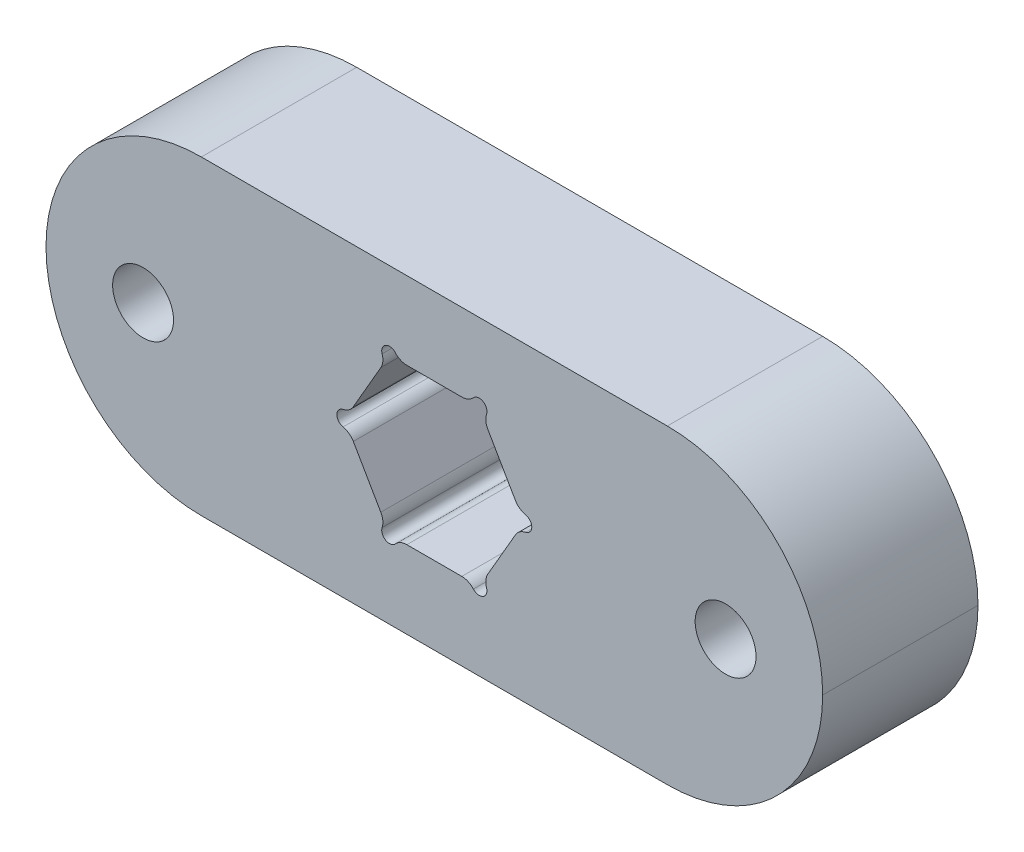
ISO-10303-21;
HEADER;
FILE_DESCRIPTION(('STEP AP214'),'2;1');
FILE_NAME('part.step','',(''),(''),'','','');
FILE_SCHEMA(('AUTOMOTIVE_DESIGN { 1 0 10303 214 1 1 1 1 }'));
ENDSEC;
DATA;
#1=APPLICATION_CONTEXT('core data for automotive mechanical design processes');
#2=APPLICATION_PROTOCOL_DEFINITION('international standard','automotive_design',2000,#1);
#3=PRODUCT_CONTEXT('',#1,'mechanical');
#4=PRODUCT('Part','Part','',(#3));
#5=PRODUCT_RELATED_PRODUCT_CATEGORY('part','',(#4));
#6=PRODUCT_DEFINITION_FORMATION('','',#4);
#7=PRODUCT_DEFINITION_CONTEXT('part definition',#1,'design');
#8=PRODUCT_DEFINITION('design','',#6,#7);
#9=PRODUCT_DEFINITION_SHAPE('','',#8);
#10=(LENGTH_UNIT() NAMED_UNIT(*) SI_UNIT(.MILLI.,.METRE.));
#11=(NAMED_UNIT(*) PLANE_ANGLE_UNIT() SI_UNIT($,.RADIAN.));
#12=(NAMED_UNIT(*) SI_UNIT($,.STERADIAN.) SOLID_ANGLE_UNIT());
#13=UNCERTAINTY_MEASURE_WITH_UNIT(LENGTH_MEASURE(1.E-05),#10,'distance_accuracy_value','');
#14=(GEOMETRIC_REPRESENTATION_CONTEXT(3) GLOBAL_UNCERTAINTY_ASSIGNED_CONTEXT((#13)) GLOBAL_UNIT_ASSIGNED_CONTEXT((#10,
#11,#12)) REPRESENTATION_CONTEXT('',''));
#15=CARTESIAN_POINT('',(0.,0.,0.));
#16=DIRECTION('',(0.,0.,1.));
#17=DIRECTION('',(1.,0.,0.));
#18=AXIS2_PLACEMENT_3D('',#15,#16,#17);
#19=CARTESIAN_POINT('',(0.,0.,12.7));
#20=DIRECTION('',(0.,0.,1.));
#21=DIRECTION('',(1.,0.,0.));
#22=AXIS2_PLACEMENT_3D('',#19,#20,#21);
#23=PLANE('',#22);
#24=DIRECTION('',(0.500000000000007,-0.866025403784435,0.));
#25=VECTOR('',#24,1.);
#26=CARTESIAN_POINT('',(-7.33234841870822,0.,12.7));
#27=LINE('',#26,#25);
#28=CARTESIAN_POINT('',(-6.62239683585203,-1.2296722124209,12.7));
#29=VERTEX_POINT('',#28);
#30=CARTESIAN_POINT('',(-4.37612579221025,-5.12032778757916,12.7));
#31=VERTEX_POINT('',#30);
#32=EDGE_CURVE('E318',#29,#31,#27,.T.);
#33=ORIENTED_EDGE('',*,*,#32,.F.);
#34=CARTESIAN_POINT('',(-7.72224909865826,-1.86467221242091,12.7));
#35=DIRECTION('',(0.,0.,1.));
#36=DIRECTION('',(1.,0.,0.));
#37=AXIS2_PLACEMENT_3D('',#34,#35,#36);
#38=CIRCLE('',#37,1.27);
#39=CARTESIAN_POINT('',(-7.4623153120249,-0.621557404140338,12.7));
#40=VERTEX_POINT('',#39);
#41=EDGE_CURVE('E263',#29,#40,#38,.T.);
#42=ORIENTED_EDGE('',*,*,#41,.T.);
#43=CARTESIAN_POINT('',(-7.33234841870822,0.,12.7));
#44=DIRECTION('',(0.,0.,1.));
#45=DIRECTION('',(1.,0.,0.));
#46=AXIS2_PLACEMENT_3D('',#43,#44,#45);
#47=CIRCLE('',#46,0.635000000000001);
#48=CARTESIAN_POINT('',(-7.46231531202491,0.621557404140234,12.7));
#49=VERTEX_POINT('',#48);
#50=EDGE_CURVE('E253',#49,#40,#47,.T.);
#51=ORIENTED_EDGE('',*,*,#50,.F.);
#52=CARTESIAN_POINT('',(-7.72224909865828,1.8646722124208,12.7));
#53=DIRECTION('',(0.,0.,1.));
#54=DIRECTION('',(1.,0.,0.));
#55=AXIS2_PLACEMENT_3D('',#52,#53,#54);
#56=CIRCLE('',#55,1.27);
#57=CARTESIAN_POINT('',(-6.62239683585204,1.22967221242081,12.7));
#58=VERTEX_POINT('',#57);
#59=EDGE_CURVE('E235',#49,#58,#56,.T.);
#60=ORIENTED_EDGE('',*,*,#59,.T.);
#61=DIRECTION('',(-0.499999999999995,-0.866025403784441,0.));
#62=VECTOR('',#61,1.);
#63=CARTESIAN_POINT('',(-3.66617420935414,6.34999999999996,12.7));
#64=LINE('',#63,#62);
#65=CARTESIAN_POINT('',(-4.37612579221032,5.1203277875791,12.7));
#66=VERTEX_POINT('',#65);
#67=EDGE_CURVE('E316',#66,#58,#64,.T.);
#68=ORIENTED_EDGE('',*,*,#67,.F.);
#69=CARTESIAN_POINT('',(-5.47597805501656,5.75532778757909,12.7));
#70=DIRECTION('',(0.,0.,1.));
#71=DIRECTION('',(1.,0.,0.));
#72=AXIS2_PLACEMENT_3D('',#69,#70,#71);
#73=CIRCLE('',#72,1.27);
#74=CARTESIAN_POINT('',(-4.26944215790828,6.15177592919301,12.7));
#75=VERTEX_POINT('',#74);
#76=EDGE_CURVE('E246',#66,#75,#73,.T.);
#77=ORIENTED_EDGE('',*,*,#76,.T.);
#78=CARTESIAN_POINT('',(-3.66617420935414,6.34999999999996,12.7));
#79=DIRECTION('',(0.,0.,1.));
#80=DIRECTION('',(1.,0.,0.));
#81=AXIS2_PLACEMENT_3D('',#78,#79,#80);
#82=CIRCLE('',#81,0.635);
#83=CARTESIAN_POINT('',(-3.19287315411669,6.7733333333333,12.7));
#84=VERTEX_POINT('',#83);
#85=EDGE_CURVE('E291',#84,#75,#82,.T.);
#86=ORIENTED_EDGE('',*,*,#85,.F.);
#87=CARTESIAN_POINT('',(-2.24627104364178,7.61999999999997,12.7));
#88=DIRECTION('',(0.,0.,1.));
#89=DIRECTION('',(1.,0.,0.));
#90=AXIS2_PLACEMENT_3D('',#87,#88,#89);
#91=CIRCLE('',#90,1.27);
#92=CARTESIAN_POINT('',(-2.24627104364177,6.34999999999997,12.7));
#93=VERTEX_POINT('',#92);
#94=EDGE_CURVE('E385',#84,#93,#91,.T.);
#95=ORIENTED_EDGE('',*,*,#94,.T.);
#96=DIRECTION('',(-1.,0.,0.));
#97=VECTOR('',#96,1.);
#98=CARTESIAN_POINT('',(3.6661742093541,6.34999999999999,12.7));
#99=LINE('',#98,#97);
#100=CARTESIAN_POINT('',(2.24627104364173,6.34999999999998,12.7));
#101=VERTEX_POINT('',#100);
#102=EDGE_CURVE('E313',#101,#93,#99,.T.);
#103=ORIENTED_EDGE('',*,*,#102,.F.);
#104=CARTESIAN_POINT('',(2.24627104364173,7.61999999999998,12.7));
#105=DIRECTION('',(0.,0.,1.));
#106=DIRECTION('',(1.,0.,0.));
#107=AXIS2_PLACEMENT_3D('',#104,#105,#106);
#108=CIRCLE('',#107,1.27);
#109=CARTESIAN_POINT('',(3.19287315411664,6.77333333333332,12.7));
#110=VERTEX_POINT('',#109);
#111=EDGE_CURVE('E245',#101,#110,#108,.T.);
#112=ORIENTED_EDGE('',*,*,#111,.T.);
#113=CARTESIAN_POINT('',(3.6661742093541,6.34999999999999,12.7));
#114=DIRECTION('',(0.,0.,1.));
#115=DIRECTION('',(1.,0.,0.));
#116=AXIS2_PLACEMENT_3D('',#113,#114,#115);
#117=CIRCLE('',#116,0.635);
#118=CARTESIAN_POINT('',(4.26944215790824,6.15177592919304,12.7));
#119=VERTEX_POINT('',#118);
#120=EDGE_CURVE('E285',#119,#110,#117,.T.);
#121=ORIENTED_EDGE('',*,*,#120,.F.);
#122=CARTESIAN_POINT('',(5.47597805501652,5.75532778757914,12.7));
#123=DIRECTION('',(0.,0.,1.));
#124=DIRECTION('',(1.,0.,0.));
#125=AXIS2_PLACEMENT_3D('',#122,#123,#124);
#126=CIRCLE('',#125,1.27);
#127=CARTESIAN_POINT('',(4.37612579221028,5.12032778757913,12.7));
#128=VERTEX_POINT('',#127);
#129=EDGE_CURVE('E389',#119,#128,#126,.T.);
#130=ORIENTED_EDGE('',*,*,#129,.T.);
#131=DIRECTION('',(-0.500000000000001,0.866025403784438,0.));
#132=VECTOR('',#131,1.);
#133=CARTESIAN_POINT('',(7.33234841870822,0.,12.7));
#134=LINE('',#133,#132);
#135=CARTESIAN_POINT('',(6.62239683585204,1.22967221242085,12.7));
#136=VERTEX_POINT('',#135);
#137=EDGE_CURVE('E309',#136,#128,#134,.T.);
#138=ORIENTED_EDGE('',*,*,#137,.F.);
#139=CARTESIAN_POINT('',(7.72224909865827,1.86467221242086,12.7));
#140=DIRECTION('',(0.,0.,1.));
#141=DIRECTION('',(1.,0.,0.));
#142=AXIS2_PLACEMENT_3D('',#139,#140,#141);
#143=CIRCLE('',#142,1.27);
#144=CARTESIAN_POINT('',(7.46231531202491,0.621557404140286,12.7));
#145=VERTEX_POINT('',#144);
#146=EDGE_CURVE('E391',#136,#145,#143,.T.);
#147=ORIENTED_EDGE('',*,*,#146,.T.);
#148=CARTESIAN_POINT('',(7.33234841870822,0.,12.7));
#149=DIRECTION('',(0.,0.,1.));
#150=DIRECTION('',(1.,0.,0.));
#151=AXIS2_PLACEMENT_3D('',#148,#149,#150);
#152=CIRCLE('',#151,0.635000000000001);
#153=CARTESIAN_POINT('',(7.46231531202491,-0.621557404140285,12.7));
#154=VERTEX_POINT('',#153);
#155=EDGE_CURVE('E279',#154,#145,#152,.T.);
#156=ORIENTED_EDGE('',*,*,#155,.F.);
#157=CARTESIAN_POINT('',(7.72224909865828,-1.86467221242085,12.7));
#158=DIRECTION('',(0.,0.,1.));
#159=DIRECTION('',(1.,0.,0.));
#160=AXIS2_PLACEMENT_3D('',#157,#158,#159);
#161=CIRCLE('',#160,1.27);
#162=CARTESIAN_POINT('',(6.62239683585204,-1.22967221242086,12.7));
#163=VERTEX_POINT('',#162);
#164=EDGE_CURVE('E393',#154,#163,#161,.T.);
#165=ORIENTED_EDGE('',*,*,#164,.T.);
#166=DIRECTION('',(0.499999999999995,0.866025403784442,0.));
#167=VECTOR('',#166,1.);
#168=CARTESIAN_POINT('',(3.66617420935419,-6.34999999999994,12.7));
#169=LINE('',#168,#167);
#170=CARTESIAN_POINT('',(4.37612579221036,-5.12032778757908,12.7));
#171=VERTEX_POINT('',#170);
#172=EDGE_CURVE('E306',#171,#163,#169,.T.);
#173=ORIENTED_EDGE('',*,*,#172,.F.);
#174=CARTESIAN_POINT('',(5.4759780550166,-5.75532778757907,12.7));
#175=DIRECTION('',(0.,0.,1.));
#176=DIRECTION('',(1.,0.,0.));
#177=AXIS2_PLACEMENT_3D('',#174,#175,#176);
#178=CIRCLE('',#177,1.27);
#179=CARTESIAN_POINT('',(4.26944215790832,-6.15177592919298,12.7));
#180=VERTEX_POINT('',#179);
#181=EDGE_CURVE('E395',#171,#180,#178,.T.);
#182=ORIENTED_EDGE('',*,*,#181,.T.);
#183=CARTESIAN_POINT('',(3.66617420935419,-6.34999999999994,12.7));
#184=DIRECTION('',(0.,0.,1.));
#185=DIRECTION('',(1.,0.,0.));
#186=AXIS2_PLACEMENT_3D('',#183,#184,#185);
#187=CIRCLE('',#186,0.635);
#188=CARTESIAN_POINT('',(3.19287315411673,-6.77333333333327,12.7));
#189=VERTEX_POINT('',#188);
#190=EDGE_CURVE('E273',#189,#180,#187,.T.);
#191=ORIENTED_EDGE('',*,*,#190,.F.);
#192=CARTESIAN_POINT('',(2.24627104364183,-7.61999999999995,12.7));
#193=DIRECTION('',(0.,0.,1.));
#194=DIRECTION('',(1.,0.,0.));
#195=AXIS2_PLACEMENT_3D('',#192,#193,#194);
#196=CIRCLE('',#195,1.27);
#197=CARTESIAN_POINT('',(2.24627104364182,-6.34999999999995,12.7));
#198=VERTEX_POINT('',#197);
#199=EDGE_CURVE('E397',#189,#198,#196,.T.);
#200=ORIENTED_EDGE('',*,*,#199,.T.);
#201=DIRECTION('',(1.,0.,0.));
#202=VECTOR('',#201,1.);
#203=CARTESIAN_POINT('',(-3.66617420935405,-6.35000000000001,12.7));
#204=LINE('',#203,#202);
#205=CARTESIAN_POINT('',(-2.24627104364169,-6.35,12.7));
#206=VERTEX_POINT('',#205);
#207=EDGE_CURVE('E321',#206,#198,#204,.T.);
#208=ORIENTED_EDGE('',*,*,#207,.F.);
#209=CARTESIAN_POINT('',(-2.24627104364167,-7.62,12.7));
#210=DIRECTION('',(0.,0.,1.));
#211=DIRECTION('',(1.,0.,0.));
#212=AXIS2_PLACEMENT_3D('',#209,#210,#211);
#213=CIRCLE('',#212,1.27);
#214=CARTESIAN_POINT('',(-3.19287315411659,-6.77333333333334,12.7));
#215=VERTEX_POINT('',#214);
#216=EDGE_CURVE('E399',#206,#215,#213,.T.);
#217=ORIENTED_EDGE('',*,*,#216,.T.);
#218=CARTESIAN_POINT('',(-3.66617420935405,-6.35000000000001,12.7));
#219=DIRECTION('',(0.,0.,1.));
#220=DIRECTION('',(1.,0.,0.));
#221=AXIS2_PLACEMENT_3D('',#218,#219,#220);
#222=CIRCLE('',#221,0.635);
#223=CARTESIAN_POINT('',(-4.26944215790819,-6.15177592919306,12.7));
#224=VERTEX_POINT('',#223);
#225=EDGE_CURVE('E266',#224,#215,#222,.T.);
#226=ORIENTED_EDGE('',*,*,#225,.F.);
#227=CARTESIAN_POINT('',(-5.47597805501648,-5.75532778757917,12.7));
#228=DIRECTION('',(0.,0.,1.));
#229=DIRECTION('',(1.,0.,0.));
#230=AXIS2_PLACEMENT_3D('',#227,#228,#229);
#231=CIRCLE('',#230,1.27);
#232=EDGE_CURVE('E401',#224,#31,#231,.T.);
#233=ORIENTED_EDGE('',*,*,#232,.T.);
#234=EDGE_LOOP('',(#33,#42,#51,#60,#68,#77,#86,#95,#103,#112,#121,#130,#138,#147,#156,#165,#173,
#182,#191,#200,#208,#217,#226,#233));
#235=FACE_BOUND('',#234,.T.);
#236=CARTESIAN_POINT('',(-23.8125,0.,12.7));
#237=DIRECTION('',(0.,0.,1.));
#238=DIRECTION('',(1.,0.,0.));
#239=AXIS2_PLACEMENT_3D('',#236,#237,#238);
#240=CIRCLE('',#239,2.4892);
#241=CARTESIAN_POINT('',(-21.3233,0.,12.7));
#242=VERTEX_POINT('',#241);
#243=EDGE_CURVE('E341',#242,#242,#240,.T.);
#244=ORIENTED_EDGE('',*,*,#243,.F.);
#245=EDGE_LOOP('',(#244));
#246=FACE_BOUND('',#245,.T.);
#247=DIRECTION('',(-1.,0.,0.));
#248=VECTOR('',#247,1.);
#249=CARTESIAN_POINT('',(31.75,12.7,12.7));
#250=LINE('',#249,#248);
#251=CARTESIAN_POINT('',(19.05,12.7,12.7));
#252=VERTEX_POINT('',#251);
#253=CARTESIAN_POINT('',(-19.05,12.7,12.7));
#254=VERTEX_POINT('',#253);
#255=EDGE_CURVE('E258',#252,#254,#250,.T.);
#256=ORIENTED_EDGE('',*,*,#255,.T.);
#257=CARTESIAN_POINT('',(-19.05,0.,12.7));
#258=DIRECTION('',(0.,0.,1.));
#259=DIRECTION('',(1.,0.,0.));
#260=AXIS2_PLACEMENT_3D('',#257,#258,#259);
#261=CIRCLE('',#260,12.7);
#262=CARTESIAN_POINT('',(-31.75,0.,12.7));
#263=VERTEX_POINT('',#262);
#264=EDGE_CURVE('E471',#254,#263,#261,.T.);
#265=ORIENTED_EDGE('',*,*,#264,.T.);
#266=CARTESIAN_POINT('',(-19.05,0.,12.7));
#267=DIRECTION('',(0.,0.,1.));
#268=DIRECTION('',(1.,0.,0.));
#269=AXIS2_PLACEMENT_3D('',#266,#267,#268);
#270=CIRCLE('',#269,12.7);
#271=CARTESIAN_POINT('',(-19.05,-12.7,12.7));
#272=VERTEX_POINT('',#271);
#273=EDGE_CURVE('E469',#263,#272,#270,.T.);
#274=ORIENTED_EDGE('',*,*,#273,.T.);
#275=DIRECTION('',(1.,0.,0.));
#276=VECTOR('',#275,1.);
#277=CARTESIAN_POINT('',(31.75,-12.7,12.7));
#278=LINE('',#277,#276);
#279=CARTESIAN_POINT('',(19.05,-12.7,12.7));
#280=VERTEX_POINT('',#279);
#281=EDGE_CURVE('E347',#272,#280,#278,.T.);
#282=ORIENTED_EDGE('',*,*,#281,.T.);
#283=CARTESIAN_POINT('',(19.05,0.,12.7));
#284=DIRECTION('',(0.,0.,1.));
#285=DIRECTION('',(1.,0.,0.));
#286=AXIS2_PLACEMENT_3D('',#283,#284,#285);
#287=CIRCLE('',#286,12.7);
#288=CARTESIAN_POINT('',(31.75,0.,12.7));
#289=VERTEX_POINT('',#288);
#290=EDGE_CURVE('E54',#280,#289,#287,.T.);
#291=ORIENTED_EDGE('',*,*,#290,.T.);
#292=CARTESIAN_POINT('',(19.05,0.,12.7));
#293=DIRECTION('',(0.,0.,1.));
#294=DIRECTION('',(1.,0.,0.));
#295=AXIS2_PLACEMENT_3D('',#292,#293,#294);
#296=CIRCLE('',#295,12.7);
#297=EDGE_CURVE('E466',#289,#252,#296,.T.);
#298=ORIENTED_EDGE('',*,*,#297,.T.);
#299=EDGE_LOOP('',(#256,#265,#274,#282,#291,#298));
#300=FACE_BOUND('',#299,.T.);
#301=CARTESIAN_POINT('',(23.8125,0.,12.7));
#302=DIRECTION('',(0.,0.,1.));
#303=DIRECTION('',(1.,0.,0.));
#304=AXIS2_PLACEMENT_3D('',#301,#302,#303);
#305=CIRCLE('',#304,2.4892);
#306=CARTESIAN_POINT('',(26.3017,0.,12.7));
#307=VERTEX_POINT('',#306);
#308=EDGE_CURVE('E300',#307,#307,#305,.T.);
#309=ORIENTED_EDGE('',*,*,#308,.F.);
#310=EDGE_LOOP('',(#309));
#311=FACE_BOUND('',#310,.T.);
#312=ADVANCED_FACE('F37',(#235,#246,#300,#311),#23,.T.);
#313=CARTESIAN_POINT('',(0.,0.,0.));
#314=DIRECTION('',(0.,0.,1.));
#315=DIRECTION('',(1.,0.,0.));
#316=AXIS2_PLACEMENT_3D('',#313,#314,#315);
#317=PLANE('',#316);
#318=CARTESIAN_POINT('',(-23.8125,0.,0.));
#319=DIRECTION('',(0.,0.,1.));
#320=DIRECTION('',(1.,0.,0.));
#321=AXIS2_PLACEMENT_3D('',#318,#319,#320);
#322=CIRCLE('',#321,2.4892);
#323=CARTESIAN_POINT('',(-21.3233,0.,0.));
#324=VERTEX_POINT('',#323);
#325=EDGE_CURVE('E324',#324,#324,#322,.T.);
#326=ORIENTED_EDGE('',*,*,#325,.T.);
#327=EDGE_LOOP('',(#326));
#328=FACE_BOUND('',#327,.T.);
#329=CARTESIAN_POINT('',(-19.05,0.,0.));
#330=DIRECTION('',(0.,0.,1.));
#331=DIRECTION('',(1.,0.,0.));
#332=AXIS2_PLACEMENT_3D('',#329,#330,#331);
#333=CIRCLE('',#332,12.7);
#334=CARTESIAN_POINT('',(-19.05,-12.7,0.));
#335=VERTEX_POINT('',#334);
#336=CARTESIAN_POINT('',(-31.75,0.,0.));
#337=VERTEX_POINT('',#336);
#338=EDGE_CURVE('E457',#335,#337,#333,.F.);
#339=ORIENTED_EDGE('',*,*,#338,.T.);
#340=CARTESIAN_POINT('',(-19.05,0.,0.));
#341=DIRECTION('',(0.,0.,1.));
#342=DIRECTION('',(1.,0.,0.));
#343=AXIS2_PLACEMENT_3D('',#340,#341,#342);
#344=CIRCLE('',#343,12.7);
#345=CARTESIAN_POINT('',(-19.05,12.7,0.));
#346=VERTEX_POINT('',#345);
#347=EDGE_CURVE('E459',#337,#346,#344,.F.);
#348=ORIENTED_EDGE('',*,*,#347,.T.);
#349=DIRECTION('',(-1.,0.,0.));
#350=VECTOR('',#349,1.);
#351=CARTESIAN_POINT('',(31.75,12.7,0.));
#352=LINE('',#351,#350);
#353=CARTESIAN_POINT('',(19.05,12.7,0.));
#354=VERTEX_POINT('',#353);
#355=EDGE_CURVE('E349',#354,#346,#352,.T.);
#356=ORIENTED_EDGE('',*,*,#355,.F.);
#357=CARTESIAN_POINT('',(19.05,0.,0.));
#358=DIRECTION('',(0.,0.,1.));
#359=DIRECTION('',(1.,0.,0.));
#360=AXIS2_PLACEMENT_3D('',#357,#358,#359);
#361=CIRCLE('',#360,12.7);
#362=CARTESIAN_POINT('',(31.75,0.,0.));
#363=VERTEX_POINT('',#362);
#364=EDGE_CURVE('E453',#354,#363,#361,.F.);
#365=ORIENTED_EDGE('',*,*,#364,.T.);
#366=CARTESIAN_POINT('',(19.05,0.,0.));
#367=DIRECTION('',(0.,0.,1.));
#368=DIRECTION('',(1.,0.,0.));
#369=AXIS2_PLACEMENT_3D('',#366,#367,#368);
#370=CIRCLE('',#369,12.7);
#371=CARTESIAN_POINT('',(19.05,-12.7,0.));
#372=VERTEX_POINT('',#371);
#373=EDGE_CURVE('E455',#363,#372,#370,.F.);
#374=ORIENTED_EDGE('',*,*,#373,.T.);
#375=DIRECTION('',(1.,0.,0.));
#376=VECTOR('',#375,1.);
#377=CARTESIAN_POINT('',(31.75,-12.7,0.));
#378=LINE('',#377,#376);
#379=EDGE_CURVE('E344',#335,#372,#378,.T.);
#380=ORIENTED_EDGE('',*,*,#379,.F.);
#381=EDGE_LOOP('',(#339,#348,#356,#365,#374,#380));
#382=FACE_BOUND('',#381,.T.);
#383=CARTESIAN_POINT('',(-7.33234841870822,0.,0.));
#384=DIRECTION('',(0.,0.,1.));
#385=DIRECTION('',(1.,0.,0.));
#386=AXIS2_PLACEMENT_3D('',#383,#384,#385);
#387=CIRCLE('',#386,0.635000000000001);
#388=CARTESIAN_POINT('',(-7.46231531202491,0.621557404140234,0.));
#389=VERTEX_POINT('',#388);
#390=CARTESIAN_POINT('',(-7.4623153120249,-0.621557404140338,0.));
#391=VERTEX_POINT('',#390);
#392=EDGE_CURVE('E256',#389,#391,#387,.T.);
#393=ORIENTED_EDGE('',*,*,#392,.T.);
#394=CARTESIAN_POINT('',(-7.72224909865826,-1.86467221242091,0.));
#395=DIRECTION('',(0.,0.,1.));
#396=DIRECTION('',(1.,0.,0.));
#397=AXIS2_PLACEMENT_3D('',#394,#395,#396);
#398=CIRCLE('',#397,1.27);
#399=CARTESIAN_POINT('',(-6.62239683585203,-1.2296722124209,0.));
#400=VERTEX_POINT('',#399);
#401=EDGE_CURVE('E379',#391,#400,#398,.F.);
#402=ORIENTED_EDGE('',*,*,#401,.T.);
#403=DIRECTION('',(0.500000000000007,-0.866025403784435,0.));
#404=VECTOR('',#403,1.);
#405=CARTESIAN_POINT('',(-7.33234841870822,0.,0.));
#406=LINE('',#405,#404);
#407=CARTESIAN_POINT('',(-4.37612579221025,-5.12032778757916,0.));
#408=VERTEX_POINT('',#407);
#409=EDGE_CURVE('E336',#400,#408,#406,.T.);
#410=ORIENTED_EDGE('',*,*,#409,.T.);
#411=CARTESIAN_POINT('',(-5.47597805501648,-5.75532778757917,0.));
#412=DIRECTION('',(0.,0.,1.));
#413=DIRECTION('',(1.,0.,0.));
#414=AXIS2_PLACEMENT_3D('',#411,#412,#413);
#415=CIRCLE('',#414,1.27);
#416=CARTESIAN_POINT('',(-4.26944215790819,-6.15177592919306,0.));
#417=VERTEX_POINT('',#416);
#418=EDGE_CURVE('E377',#408,#417,#415,.F.);
#419=ORIENTED_EDGE('',*,*,#418,.T.);
#420=CARTESIAN_POINT('',(-3.66617420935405,-6.35000000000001,0.));
#421=DIRECTION('',(0.,0.,1.));
#422=DIRECTION('',(1.,0.,0.));
#423=AXIS2_PLACEMENT_3D('',#420,#421,#422);
#424=CIRCLE('',#423,0.635);
#425=CARTESIAN_POINT('',(-3.19287315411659,-6.77333333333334,0.));
#426=VERTEX_POINT('',#425);
#427=EDGE_CURVE('E270',#417,#426,#424,.T.);
#428=ORIENTED_EDGE('',*,*,#427,.T.);
#429=CARTESIAN_POINT('',(-2.24627104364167,-7.62,0.));
#430=DIRECTION('',(0.,0.,1.));
#431=DIRECTION('',(1.,0.,0.));
#432=AXIS2_PLACEMENT_3D('',#429,#430,#431);
#433=CIRCLE('',#432,1.27);
#434=CARTESIAN_POINT('',(-2.24627104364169,-6.35,0.));
#435=VERTEX_POINT('',#434);
#436=EDGE_CURVE('E375',#426,#435,#433,.F.);
#437=ORIENTED_EDGE('',*,*,#436,.T.);
#438=DIRECTION('',(1.,0.,0.));
#439=VECTOR('',#438,1.);
#440=CARTESIAN_POINT('',(-3.66617420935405,-6.35000000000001,0.));
#441=LINE('',#440,#439);
#442=CARTESIAN_POINT('',(2.24627104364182,-6.34999999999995,0.));
#443=VERTEX_POINT('',#442);
#444=EDGE_CURVE('E310',#435,#443,#441,.T.);
#445=ORIENTED_EDGE('',*,*,#444,.T.);
#446=CARTESIAN_POINT('',(2.24627104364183,-7.61999999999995,0.));
#447=DIRECTION('',(0.,0.,1.));
#448=DIRECTION('',(1.,0.,0.));
#449=AXIS2_PLACEMENT_3D('',#446,#447,#448);
#450=CIRCLE('',#449,1.27);
#451=CARTESIAN_POINT('',(3.19287315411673,-6.77333333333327,0.));
#452=VERTEX_POINT('',#451);
#453=EDGE_CURVE('E373',#443,#452,#450,.F.);
#454=ORIENTED_EDGE('',*,*,#453,.T.);
#455=CARTESIAN_POINT('',(3.66617420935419,-6.34999999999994,0.));
#456=DIRECTION('',(0.,0.,1.));
#457=DIRECTION('',(1.,0.,0.));
#458=AXIS2_PLACEMENT_3D('',#455,#456,#457);
#459=CIRCLE('',#458,0.635);
#460=CARTESIAN_POINT('',(4.26944215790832,-6.15177592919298,0.));
#461=VERTEX_POINT('',#460);
#462=EDGE_CURVE('E276',#452,#461,#459,.T.);
#463=ORIENTED_EDGE('',*,*,#462,.T.);
#464=CARTESIAN_POINT('',(5.4759780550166,-5.75532778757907,0.));
#465=DIRECTION('',(0.,0.,1.));
#466=DIRECTION('',(1.,0.,0.));
#467=AXIS2_PLACEMENT_3D('',#464,#465,#466);
#468=CIRCLE('',#467,1.27);
#469=CARTESIAN_POINT('',(4.37612579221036,-5.12032778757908,0.));
#470=VERTEX_POINT('',#469);
#471=EDGE_CURVE('E371',#461,#470,#468,.F.);
#472=ORIENTED_EDGE('',*,*,#471,.T.);
#473=DIRECTION('',(0.499999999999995,0.866025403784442,0.));
#474=VECTOR('',#473,1.);
#475=CARTESIAN_POINT('',(3.66617420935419,-6.34999999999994,0.));
#476=LINE('',#475,#474);
#477=CARTESIAN_POINT('',(6.62239683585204,-1.22967221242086,0.));
#478=VERTEX_POINT('',#477);
#479=EDGE_CURVE('E303',#470,#478,#476,.T.);
#480=ORIENTED_EDGE('',*,*,#479,.T.);
#481=CARTESIAN_POINT('',(7.72224909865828,-1.86467221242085,0.));
#482=DIRECTION('',(0.,0.,1.));
#483=DIRECTION('',(1.,0.,0.));
#484=AXIS2_PLACEMENT_3D('',#481,#482,#483);
#485=CIRCLE('',#484,1.27);
#486=CARTESIAN_POINT('',(7.46231531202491,-0.621557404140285,0.));
#487=VERTEX_POINT('',#486);
#488=EDGE_CURVE('E369',#478,#487,#485,.F.);
#489=ORIENTED_EDGE('',*,*,#488,.T.);
#490=CARTESIAN_POINT('',(7.33234841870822,0.,0.));
#491=DIRECTION('',(0.,0.,1.));
#492=DIRECTION('',(1.,0.,0.));
#493=AXIS2_PLACEMENT_3D('',#490,#491,#492);
#494=CIRCLE('',#493,0.635000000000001);
#495=CARTESIAN_POINT('',(7.46231531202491,0.621557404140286,0.));
#496=VERTEX_POINT('',#495);
#497=EDGE_CURVE('E282',#487,#496,#494,.T.);
#498=ORIENTED_EDGE('',*,*,#497,.T.);
#499=CARTESIAN_POINT('',(7.72224909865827,1.86467221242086,0.));
#500=DIRECTION('',(0.,0.,1.));
#501=DIRECTION('',(1.,0.,0.));
#502=AXIS2_PLACEMENT_3D('',#499,#500,#501);
#503=CIRCLE('',#502,1.27);
#504=CARTESIAN_POINT('',(6.62239683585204,1.22967221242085,0.));
#505=VERTEX_POINT('',#504);
#506=EDGE_CURVE('E367',#496,#505,#503,.F.);
#507=ORIENTED_EDGE('',*,*,#506,.T.);
#508=DIRECTION('',(-0.500000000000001,0.866025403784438,0.));
#509=VECTOR('',#508,1.);
#510=CARTESIAN_POINT('',(7.33234841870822,0.,0.));
#511=LINE('',#510,#509);
#512=CARTESIAN_POINT('',(4.37612579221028,5.12032778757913,0.));
#513=VERTEX_POINT('',#512);
#514=EDGE_CURVE('E327',#505,#513,#511,.T.);
#515=ORIENTED_EDGE('',*,*,#514,.T.);
#516=CARTESIAN_POINT('',(5.47597805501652,5.75532778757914,0.));
#517=DIRECTION('',(0.,0.,1.));
#518=DIRECTION('',(1.,0.,0.));
#519=AXIS2_PLACEMENT_3D('',#516,#517,#518);
#520=CIRCLE('',#519,1.27);
#521=CARTESIAN_POINT('',(4.26944215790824,6.15177592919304,0.));
#522=VERTEX_POINT('',#521);
#523=EDGE_CURVE('E365',#513,#522,#520,.F.);
#524=ORIENTED_EDGE('',*,*,#523,.T.);
#525=CARTESIAN_POINT('',(3.6661742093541,6.34999999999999,0.));
#526=DIRECTION('',(0.,0.,1.));
#527=DIRECTION('',(1.,0.,0.));
#528=AXIS2_PLACEMENT_3D('',#525,#526,#527);
#529=CIRCLE('',#528,0.635);
#530=CARTESIAN_POINT('',(3.19287315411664,6.77333333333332,0.));
#531=VERTEX_POINT('',#530);
#532=EDGE_CURVE('E288',#522,#531,#529,.T.);
#533=ORIENTED_EDGE('',*,*,#532,.T.);
#534=CARTESIAN_POINT('',(2.24627104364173,7.61999999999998,0.));
#535=DIRECTION('',(0.,0.,1.));
#536=DIRECTION('',(1.,0.,0.));
#537=AXIS2_PLACEMENT_3D('',#534,#535,#536);
#538=CIRCLE('',#537,1.27);
#539=CARTESIAN_POINT('',(2.24627104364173,6.34999999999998,0.));
#540=VERTEX_POINT('',#539);
#541=EDGE_CURVE('E363',#531,#540,#538,.F.);
#542=ORIENTED_EDGE('',*,*,#541,.T.);
#543=DIRECTION('',(-1.,0.,0.));
#544=VECTOR('',#543,1.);
#545=CARTESIAN_POINT('',(3.6661742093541,6.34999999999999,0.));
#546=LINE('',#545,#544);
#547=CARTESIAN_POINT('',(-2.24627104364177,6.34999999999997,0.));
#548=VERTEX_POINT('',#547);
#549=EDGE_CURVE('E330',#540,#548,#546,.T.);
#550=ORIENTED_EDGE('',*,*,#549,.T.);
#551=CARTESIAN_POINT('',(-2.24627104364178,7.61999999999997,0.));
#552=DIRECTION('',(0.,0.,1.));
#553=DIRECTION('',(1.,0.,0.));
#554=AXIS2_PLACEMENT_3D('',#551,#552,#553);
#555=CIRCLE('',#554,1.27);
#556=CARTESIAN_POINT('',(-3.19287315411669,6.7733333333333,0.));
#557=VERTEX_POINT('',#556);
#558=EDGE_CURVE('E357',#548,#557,#555,.F.);
#559=ORIENTED_EDGE('',*,*,#558,.T.);
#560=CARTESIAN_POINT('',(-3.66617420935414,6.34999999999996,0.));
#561=DIRECTION('',(0.,0.,1.));
#562=DIRECTION('',(1.,0.,0.));
#563=AXIS2_PLACEMENT_3D('',#560,#561,#562);
#564=CIRCLE('',#563,0.635);
#565=CARTESIAN_POINT('',(-4.26944215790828,6.15177592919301,0.));
#566=VERTEX_POINT('',#565);
#567=EDGE_CURVE('E294',#557,#566,#564,.T.);
#568=ORIENTED_EDGE('',*,*,#567,.T.);
#569=CARTESIAN_POINT('',(-5.47597805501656,5.75532778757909,0.));
#570=DIRECTION('',(0.,0.,1.));
#571=DIRECTION('',(1.,0.,0.));
#572=AXIS2_PLACEMENT_3D('',#569,#570,#571);
#573=CIRCLE('',#572,1.27);
#574=CARTESIAN_POINT('',(-4.37612579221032,5.1203277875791,0.));
#575=VERTEX_POINT('',#574);
#576=EDGE_CURVE('E359',#566,#575,#573,.F.);
#577=ORIENTED_EDGE('',*,*,#576,.T.);
#578=DIRECTION('',(-0.499999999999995,-0.866025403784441,0.));
#579=VECTOR('',#578,1.);
#580=CARTESIAN_POINT('',(-3.66617420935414,6.34999999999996,0.));
#581=LINE('',#580,#579);
#582=CARTESIAN_POINT('',(-6.62239683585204,1.22967221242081,0.));
#583=VERTEX_POINT('',#582);
#584=EDGE_CURVE('E333',#575,#583,#581,.T.);
#585=ORIENTED_EDGE('',*,*,#584,.T.);
#586=CARTESIAN_POINT('',(-7.72224909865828,1.8646722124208,0.));
#587=DIRECTION('',(0.,0.,1.));
#588=DIRECTION('',(1.,0.,0.));
#589=AXIS2_PLACEMENT_3D('',#586,#587,#588);
#590=CIRCLE('',#589,1.27);
#591=EDGE_CURVE('E361',#583,#389,#590,.F.);
#592=ORIENTED_EDGE('',*,*,#591,.T.);
#593=EDGE_LOOP('',(#393,#402,#410,#419,#428,#437,#445,#454,#463,#472,#480,#489,#498,#507,#515,
#524,#533,#542,#550,#559,#568,#577,#585,#592));
#594=FACE_BOUND('',#593,.T.);
#595=CARTESIAN_POINT('',(23.8125,0.,0.));
#596=DIRECTION('',(0.,0.,1.));
#597=DIRECTION('',(1.,0.,0.));
#598=AXIS2_PLACEMENT_3D('',#595,#596,#597);
#599=CIRCLE('',#598,2.4892);
#600=CARTESIAN_POINT('',(26.3017,0.,0.));
#601=VERTEX_POINT('',#600);
#602=EDGE_CURVE('E297',#601,#601,#599,.T.);
#603=ORIENTED_EDGE('',*,*,#602,.T.);
#604=EDGE_LOOP('',(#603));
#605=FACE_BOUND('',#604,.T.);
#606=ADVANCED_FACE('F491',(#328,#382,#594,#605),#317,.F.);
#607=CARTESIAN_POINT('',(31.75,-12.7,12.7));
#608=DIRECTION('',(0.,1.,0.));
#609=DIRECTION('',(-1.,0.,0.));
#610=AXIS2_PLACEMENT_3D('',#607,#608,#609);
#611=PLANE('',#610);
#612=ORIENTED_EDGE('',*,*,#281,.F.);
#613=DIRECTION('',(0.,0.,-1.));
#614=VECTOR('',#613,1.);
#615=CARTESIAN_POINT('',(-19.05,-12.7,12.7));
#616=LINE('',#615,#614);
#617=EDGE_CURVE('E11',#272,#335,#616,.T.);
#618=ORIENTED_EDGE('',*,*,#617,.T.);
#619=ORIENTED_EDGE('',*,*,#379,.T.);
#620=DIRECTION('',(0.,0.,-1.));
#621=VECTOR('',#620,1.);
#622=CARTESIAN_POINT('',(19.05,-12.7,12.7));
#623=LINE('',#622,#621);
#624=EDGE_CURVE('E46',#372,#280,#623,.F.);
#625=ORIENTED_EDGE('',*,*,#624,.T.);
#626=EDGE_LOOP('',(#612,#618,#619,#625));
#627=FACE_BOUND('',#626,.T.);
#628=ADVANCED_FACE('F475',(#627),#611,.F.);
#629=CARTESIAN_POINT('',(31.75,12.7,12.7));
#630=DIRECTION('',(0.,-1.,0.));
#631=DIRECTION('',(1.,0.,0.));
#632=AXIS2_PLACEMENT_3D('',#629,#630,#631);
#633=PLANE('',#632);
#634=ORIENTED_EDGE('',*,*,#355,.T.);
#635=DIRECTION('',(0.,0.,-1.));
#636=VECTOR('',#635,1.);
#637=CARTESIAN_POINT('',(-19.05,12.7,12.7));
#638=LINE('',#637,#636);
#639=EDGE_CURVE('E463',#346,#254,#638,.F.);
#640=ORIENTED_EDGE('',*,*,#639,.T.);
#641=ORIENTED_EDGE('',*,*,#255,.F.);
#642=DIRECTION('',(0.,0.,-1.));
#643=VECTOR('',#642,1.);
#644=CARTESIAN_POINT('',(19.05,12.7,12.7));
#645=LINE('',#644,#643);
#646=EDGE_CURVE('E461',#252,#354,#645,.T.);
#647=ORIENTED_EDGE('',*,*,#646,.T.);
#648=EDGE_LOOP('',(#634,#640,#641,#647));
#649=FACE_BOUND('',#648,.T.);
#650=ADVANCED_FACE('F495',(#649),#633,.F.);
#651=CARTESIAN_POINT('',(-23.8125,0.,12.7));
#652=DIRECTION('',(0.,0.,-1.));
#653=DIRECTION('',(-1.,0.,0.));
#654=AXIS2_PLACEMENT_3D('',#651,#652,#653);
#655=CYLINDRICAL_SURFACE('',#654,2.4892);
#656=ORIENTED_EDGE('',*,*,#243,.T.);
#657=EDGE_LOOP('',(#656));
#658=FACE_BOUND('',#657,.T.);
#659=ORIENTED_EDGE('',*,*,#325,.F.);
#660=EDGE_LOOP('',(#659));
#661=FACE_BOUND('',#660,.T.);
#662=ADVANCED_FACE('F514',(#658,#661),#655,.F.);
#663=CARTESIAN_POINT('',(3.66617420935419,-6.34999999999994,12.7));
#664=DIRECTION('',(-0.866025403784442,0.499999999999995,0.));
#665=DIRECTION('',(-0.499999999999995,-0.866025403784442,0.));
#666=AXIS2_PLACEMENT_3D('',#663,#664,#665);
#667=PLANE('',#666);
#668=ORIENTED_EDGE('',*,*,#479,.F.);
#669=DIRECTION('',(0.,0.,-1.));
#670=VECTOR('',#669,1.);
#671=CARTESIAN_POINT('',(4.37612579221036,-5.12032778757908,12.7));
#672=LINE('',#671,#670);
#673=EDGE_CURVE('E422',#470,#171,#672,.F.);
#674=ORIENTED_EDGE('',*,*,#673,.T.);
#675=ORIENTED_EDGE('',*,*,#172,.T.);
#676=DIRECTION('',(0.,0.,-1.));
#677=VECTOR('',#676,1.);
#678=CARTESIAN_POINT('',(6.62239683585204,-1.22967221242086,0.));
#679=LINE('',#678,#677);
#680=EDGE_CURVE('E420',#163,#478,#679,.T.);
#681=ORIENTED_EDGE('',*,*,#680,.T.);
#682=EDGE_LOOP('',(#668,#674,#675,#681));
#683=FACE_BOUND('',#682,.T.);
#684=ADVANCED_FACE('F759',(#683),#667,.T.);
#685=CARTESIAN_POINT('',(7.33234841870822,0.,12.7));
#686=DIRECTION('',(-0.866025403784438,-0.500000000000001,0.));
#687=DIRECTION('',(0.500000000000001,-0.866025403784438,0.));
#688=AXIS2_PLACEMENT_3D('',#685,#686,#687);
#689=PLANE('',#688);
#690=ORIENTED_EDGE('',*,*,#514,.F.);
#691=DIRECTION('',(0.,0.,-1.));
#692=VECTOR('',#691,1.);
#693=CARTESIAN_POINT('',(6.62239683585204,1.22967221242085,12.7));
#694=LINE('',#693,#692);
#695=EDGE_CURVE('E432',#505,#136,#694,.F.);
#696=ORIENTED_EDGE('',*,*,#695,.T.);
#697=ORIENTED_EDGE('',*,*,#137,.T.);
#698=DIRECTION('',(0.,0.,-1.));
#699=VECTOR('',#698,1.);
#700=CARTESIAN_POINT('',(4.37612579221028,5.12032778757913,0.));
#701=LINE('',#700,#699);
#702=EDGE_CURVE('E430',#128,#513,#701,.T.);
#703=ORIENTED_EDGE('',*,*,#702,.T.);
#704=EDGE_LOOP('',(#690,#696,#697,#703));
#705=FACE_BOUND('',#704,.T.);
#706=ADVANCED_FACE('F750',(#705),#689,.T.);
#707=CARTESIAN_POINT('',(3.6661742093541,6.34999999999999,12.7));
#708=DIRECTION('',(0.,-1.,0.));
#709=DIRECTION('',(1.,0.,0.));
#710=AXIS2_PLACEMENT_3D('',#707,#708,#709);
#711=PLANE('',#710);
#712=ORIENTED_EDGE('',*,*,#549,.F.);
#713=DIRECTION('',(0.,0.,-1.));
#714=VECTOR('',#713,1.);
#715=CARTESIAN_POINT('',(2.24627104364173,6.34999999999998,12.7));
#716=LINE('',#715,#714);
#717=EDGE_CURVE('E442',#540,#101,#716,.F.);
#718=ORIENTED_EDGE('',*,*,#717,.T.);
#719=ORIENTED_EDGE('',*,*,#102,.T.);
#720=DIRECTION('',(0.,0.,-1.));
#721=VECTOR('',#720,1.);
#722=CARTESIAN_POINT('',(-2.24627104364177,6.34999999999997,0.));
#723=LINE('',#722,#721);
#724=EDGE_CURVE('E440',#93,#548,#723,.T.);
#725=ORIENTED_EDGE('',*,*,#724,.T.);
#726=EDGE_LOOP('',(#712,#718,#719,#725));
#727=FACE_BOUND('',#726,.T.);
#728=ADVANCED_FACE('F741',(#727),#711,.T.);
#729=CARTESIAN_POINT('',(-3.66617420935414,6.34999999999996,12.7));
#730=DIRECTION('',(0.866025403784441,-0.499999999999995,0.));
#731=DIRECTION('',(0.499999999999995,0.866025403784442,0.));
#732=AXIS2_PLACEMENT_3D('',#729,#730,#731);
#733=PLANE('',#732);
#734=ORIENTED_EDGE('',*,*,#67,.T.);
#735=DIRECTION('',(0.,0.,-1.));
#736=VECTOR('',#735,1.);
#737=CARTESIAN_POINT('',(-6.62239683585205,1.22967221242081,0.));
#738=LINE('',#737,#736);
#739=EDGE_CURVE('E240',#58,#583,#738,.T.);
#740=ORIENTED_EDGE('',*,*,#739,.T.);
#741=ORIENTED_EDGE('',*,*,#584,.F.);
#742=DIRECTION('',(0.,0.,-1.));
#743=VECTOR('',#742,1.);
#744=CARTESIAN_POINT('',(-4.37612579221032,5.1203277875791,12.7));
#745=LINE('',#744,#743);
#746=EDGE_CURVE('E444',#575,#66,#745,.F.);
#747=ORIENTED_EDGE('',*,*,#746,.T.);
#748=EDGE_LOOP('',(#734,#740,#741,#747));
#749=FACE_BOUND('',#748,.T.);
#750=ADVANCED_FACE('F732',(#749),#733,.T.);
#751=CARTESIAN_POINT('',(-7.33234841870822,0.,12.7));
#752=DIRECTION('',(0.866025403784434,0.500000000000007,0.));
#753=DIRECTION('',(-0.500000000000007,0.866025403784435,0.));
#754=AXIS2_PLACEMENT_3D('',#751,#752,#753);
#755=PLANE('',#754);
#756=ORIENTED_EDGE('',*,*,#409,.F.);
#757=DIRECTION('',(0.,0.,-1.));
#758=VECTOR('',#757,1.);
#759=CARTESIAN_POINT('',(-6.62239683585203,-1.2296722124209,12.7));
#760=LINE('',#759,#758);
#761=EDGE_CURVE('E383',#400,#29,#760,.F.);
#762=ORIENTED_EDGE('',*,*,#761,.T.);
#763=ORIENTED_EDGE('',*,*,#32,.T.);
#764=DIRECTION('',(0.,0.,-1.));
#765=VECTOR('',#764,1.);
#766=CARTESIAN_POINT('',(-4.37612579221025,-5.12032778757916,0.));
#767=LINE('',#766,#765);
#768=EDGE_CURVE('E381',#31,#408,#767,.T.);
#769=ORIENTED_EDGE('',*,*,#768,.T.);
#770=EDGE_LOOP('',(#756,#762,#763,#769));
#771=FACE_BOUND('',#770,.T.);
#772=ADVANCED_FACE('F723',(#771),#755,.T.);
#773=CARTESIAN_POINT('',(-3.66617420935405,-6.35000000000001,12.7));
#774=DIRECTION('',(0.,1.,0.));
#775=DIRECTION('',(-1.,0.,0.));
#776=AXIS2_PLACEMENT_3D('',#773,#774,#775);
#777=PLANE('',#776);
#778=ORIENTED_EDGE('',*,*,#444,.F.);
#779=DIRECTION('',(0.,0.,-1.));
#780=VECTOR('',#779,1.);
#781=CARTESIAN_POINT('',(-2.24627104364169,-6.35,12.7));
#782=LINE('',#781,#780);
#783=EDGE_CURVE('E412',#435,#206,#782,.F.);
#784=ORIENTED_EDGE('',*,*,#783,.T.);
#785=ORIENTED_EDGE('',*,*,#207,.T.);
#786=DIRECTION('',(0.,0.,-1.));
#787=VECTOR('',#786,1.);
#788=CARTESIAN_POINT('',(2.24627104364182,-6.34999999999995,0.));
#789=LINE('',#788,#787);
#790=EDGE_CURVE('E410',#198,#443,#789,.T.);
#791=ORIENTED_EDGE('',*,*,#790,.T.);
#792=EDGE_LOOP('',(#778,#784,#785,#791));
#793=FACE_BOUND('',#792,.T.);
#794=ADVANCED_FACE('F713',(#793),#777,.T.);
#795=CARTESIAN_POINT('',(23.8125,0.,12.7));
#796=DIRECTION('',(0.,0.,-1.));
#797=DIRECTION('',(-1.,0.,0.));
#798=AXIS2_PLACEMENT_3D('',#795,#796,#797);
#799=CYLINDRICAL_SURFACE('',#798,2.4892);
#800=ORIENTED_EDGE('',*,*,#308,.T.);
#801=EDGE_LOOP('',(#800));
#802=FACE_BOUND('',#801,.T.);
#803=ORIENTED_EDGE('',*,*,#602,.F.);
#804=EDGE_LOOP('',(#803));
#805=FACE_BOUND('',#804,.T.);
#806=ADVANCED_FACE('F703',(#802,#805),#799,.F.);
#807=CARTESIAN_POINT('',(-3.66617420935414,6.34999999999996,0.));
#808=DIRECTION('',(0.,0.,1.));
#809=DIRECTION('',(1.,0.,0.));
#810=AXIS2_PLACEMENT_3D('',#807,#808,#809);
#811=CYLINDRICAL_SURFACE('',#810,0.635);
#812=ORIENTED_EDGE('',*,*,#85,.T.);
#813=DIRECTION('',(0.,0.,1.));
#814=VECTOR('',#813,1.);
#815=CARTESIAN_POINT('',(-4.26944215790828,6.15177592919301,0.));
#816=LINE('',#815,#814);
#817=EDGE_CURVE('E450',#75,#566,#816,.F.);
#818=ORIENTED_EDGE('',*,*,#817,.T.);
#819=ORIENTED_EDGE('',*,*,#567,.F.);
#820=DIRECTION('',(0.,0.,1.));
#821=VECTOR('',#820,1.);
#822=CARTESIAN_POINT('',(-3.19287315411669,6.7733333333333,0.));
#823=LINE('',#822,#821);
#824=EDGE_CURVE('E447',#557,#84,#823,.T.);
#825=ORIENTED_EDGE('',*,*,#824,.T.);
#826=EDGE_LOOP('',(#812,#818,#819,#825));
#827=FACE_BOUND('',#826,.T.);
#828=ADVANCED_FACE('F694',(#827),#811,.F.);
#829=CARTESIAN_POINT('',(3.6661742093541,6.34999999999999,0.));
#830=DIRECTION('',(0.,0.,1.));
#831=DIRECTION('',(1.,0.,0.));
#832=AXIS2_PLACEMENT_3D('',#829,#830,#831);
#833=CYLINDRICAL_SURFACE('',#832,0.635);
#834=ORIENTED_EDGE('',*,*,#532,.F.);
#835=DIRECTION('',(0.,0.,1.));
#836=VECTOR('',#835,1.);
#837=CARTESIAN_POINT('',(4.26944215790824,6.15177592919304,0.));
#838=LINE('',#837,#836);
#839=EDGE_CURVE('E437',#522,#119,#838,.T.);
#840=ORIENTED_EDGE('',*,*,#839,.T.);
#841=ORIENTED_EDGE('',*,*,#120,.T.);
#842=DIRECTION('',(0.,0.,1.));
#843=VECTOR('',#842,1.);
#844=CARTESIAN_POINT('',(3.19287315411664,6.77333333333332,0.));
#845=LINE('',#844,#843);
#846=EDGE_CURVE('E434',#110,#531,#845,.F.);
#847=ORIENTED_EDGE('',*,*,#846,.T.);
#848=EDGE_LOOP('',(#834,#840,#841,#847));
#849=FACE_BOUND('',#848,.T.);
#850=ADVANCED_FACE('F685',(#849),#833,.F.);
#851=CARTESIAN_POINT('',(7.33234841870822,0.,0.));
#852=DIRECTION('',(0.,0.,1.));
#853=DIRECTION('',(1.,0.,0.));
#854=AXIS2_PLACEMENT_3D('',#851,#852,#853);
#855=CYLINDRICAL_SURFACE('',#854,0.635000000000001);
#856=ORIENTED_EDGE('',*,*,#497,.F.);
#857=DIRECTION('',(0.,0.,1.));
#858=VECTOR('',#857,1.);
#859=CARTESIAN_POINT('',(7.46231531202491,-0.621557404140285,0.));
#860=LINE('',#859,#858);
#861=EDGE_CURVE('E427',#487,#154,#860,.T.);
#862=ORIENTED_EDGE('',*,*,#861,.T.);
#863=ORIENTED_EDGE('',*,*,#155,.T.);
#864=DIRECTION('',(0.,0.,1.));
#865=VECTOR('',#864,1.);
#866=CARTESIAN_POINT('',(7.46231531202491,0.621557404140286,0.));
#867=LINE('',#866,#865);
#868=EDGE_CURVE('E424',#145,#496,#867,.F.);
#869=ORIENTED_EDGE('',*,*,#868,.T.);
#870=EDGE_LOOP('',(#856,#862,#863,#869));
#871=FACE_BOUND('',#870,.T.);
#872=ADVANCED_FACE('F676',(#871),#855,.F.);
#873=CARTESIAN_POINT('',(3.66617420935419,-6.34999999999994,0.));
#874=DIRECTION('',(0.,0.,1.));
#875=DIRECTION('',(1.,0.,0.));
#876=AXIS2_PLACEMENT_3D('',#873,#874,#875);
#877=CYLINDRICAL_SURFACE('',#876,0.635);
#878=ORIENTED_EDGE('',*,*,#462,.F.);
#879=DIRECTION('',(0.,0.,1.));
#880=VECTOR('',#879,1.);
#881=CARTESIAN_POINT('',(3.19287315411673,-6.77333333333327,0.));
#882=LINE('',#881,#880);
#883=EDGE_CURVE('E417',#452,#189,#882,.T.);
#884=ORIENTED_EDGE('',*,*,#883,.T.);
#885=ORIENTED_EDGE('',*,*,#190,.T.);
#886=DIRECTION('',(0.,0.,1.));
#887=VECTOR('',#886,1.);
#888=CARTESIAN_POINT('',(4.26944215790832,-6.15177592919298,0.));
#889=LINE('',#888,#887);
#890=EDGE_CURVE('E414',#180,#461,#889,.F.);
#891=ORIENTED_EDGE('',*,*,#890,.T.);
#892=EDGE_LOOP('',(#878,#884,#885,#891));
#893=FACE_BOUND('',#892,.T.);
#894=ADVANCED_FACE('F667',(#893),#877,.F.);
#895=CARTESIAN_POINT('',(-3.66617420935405,-6.35000000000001,0.));
#896=DIRECTION('',(0.,0.,1.));
#897=DIRECTION('',(1.,0.,0.));
#898=AXIS2_PLACEMENT_3D('',#895,#896,#897);
#899=CYLINDRICAL_SURFACE('',#898,0.635);
#900=ORIENTED_EDGE('',*,*,#427,.F.);
#901=DIRECTION('',(0.,0.,1.));
#902=VECTOR('',#901,1.);
#903=CARTESIAN_POINT('',(-4.26944215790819,-6.15177592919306,0.));
#904=LINE('',#903,#902);
#905=EDGE_CURVE('E407',#417,#224,#904,.T.);
#906=ORIENTED_EDGE('',*,*,#905,.T.);
#907=ORIENTED_EDGE('',*,*,#225,.T.);
#908=DIRECTION('',(0.,0.,1.));
#909=VECTOR('',#908,1.);
#910=CARTESIAN_POINT('',(-3.19287315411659,-6.77333333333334,0.));
#911=LINE('',#910,#909);
#912=EDGE_CURVE('E404',#215,#426,#911,.F.);
#913=ORIENTED_EDGE('',*,*,#912,.T.);
#914=EDGE_LOOP('',(#900,#906,#907,#913));
#915=FACE_BOUND('',#914,.T.);
#916=ADVANCED_FACE('F659',(#915),#899,.F.);
#917=CARTESIAN_POINT('',(-7.33234841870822,0.,0.));
#918=DIRECTION('',(0.,0.,1.));
#919=DIRECTION('',(1.,0.,0.));
#920=AXIS2_PLACEMENT_3D('',#917,#918,#919);
#921=CYLINDRICAL_SURFACE('',#920,0.635000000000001);
#922=ORIENTED_EDGE('',*,*,#50,.T.);
#923=DIRECTION('',(0.,0.,1.));
#924=VECTOR('',#923,1.);
#925=CARTESIAN_POINT('',(-7.4623153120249,-0.621557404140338,0.));
#926=LINE('',#925,#924);
#927=EDGE_CURVE('E257',#40,#391,#926,.F.);
#928=ORIENTED_EDGE('',*,*,#927,.T.);
#929=ORIENTED_EDGE('',*,*,#392,.F.);
#930=DIRECTION('',(0.,0.,1.));
#931=VECTOR('',#930,1.);
#932=CARTESIAN_POINT('',(-7.46231531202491,0.621557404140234,0.));
#933=LINE('',#932,#931);
#934=EDGE_CURVE('E239',#389,#49,#933,.T.);
#935=ORIENTED_EDGE('',*,*,#934,.T.);
#936=EDGE_LOOP('',(#922,#928,#929,#935));
#937=FACE_BOUND('',#936,.T.);
#938=ADVANCED_FACE('F251',(#937),#921,.F.);
#939=CARTESIAN_POINT('',(-7.72224909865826,-1.86467221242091,0.));
#940=DIRECTION('',(0.,0.,1.));
#941=DIRECTION('',(1.,0.,0.));
#942=AXIS2_PLACEMENT_3D('',#939,#940,#941);
#943=CYLINDRICAL_SURFACE('',#942,1.27);
#944=ORIENTED_EDGE('',*,*,#41,.F.);
#945=ORIENTED_EDGE('',*,*,#761,.F.);
#946=ORIENTED_EDGE('',*,*,#401,.F.);
#947=ORIENTED_EDGE('',*,*,#927,.F.);
#948=EDGE_LOOP('',(#944,#945,#946,#947));
#949=FACE_BOUND('',#948,.T.);
#950=ADVANCED_FACE('F521',(#949),#943,.T.);
#951=CARTESIAN_POINT('',(-5.47597805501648,-5.75532778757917,0.));
#952=DIRECTION('',(0.,0.,1.));
#953=DIRECTION('',(1.,0.,0.));
#954=AXIS2_PLACEMENT_3D('',#951,#952,#953);
#955=CYLINDRICAL_SURFACE('',#954,1.27);
#956=ORIENTED_EDGE('',*,*,#418,.F.);
#957=ORIENTED_EDGE('',*,*,#768,.F.);
#958=ORIENTED_EDGE('',*,*,#232,.F.);
#959=ORIENTED_EDGE('',*,*,#905,.F.);
#960=EDGE_LOOP('',(#956,#957,#958,#959));
#961=FACE_BOUND('',#960,.T.);
#962=ADVANCED_FACE('F524',(#961),#955,.T.);
#963=CARTESIAN_POINT('',(-2.24627104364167,-7.62,0.));
#964=DIRECTION('',(0.,0.,1.));
#965=DIRECTION('',(1.,0.,0.));
#966=AXIS2_PLACEMENT_3D('',#963,#964,#965);
#967=CYLINDRICAL_SURFACE('',#966,1.27);
#968=ORIENTED_EDGE('',*,*,#216,.F.);
#969=ORIENTED_EDGE('',*,*,#783,.F.);
#970=ORIENTED_EDGE('',*,*,#436,.F.);
#971=ORIENTED_EDGE('',*,*,#912,.F.);
#972=EDGE_LOOP('',(#968,#969,#970,#971));
#973=FACE_BOUND('',#972,.T.);
#974=ADVANCED_FACE('F528',(#973),#967,.T.);
#975=CARTESIAN_POINT('',(2.24627104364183,-7.61999999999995,0.));
#976=DIRECTION('',(0.,0.,1.));
#977=DIRECTION('',(1.,0.,0.));
#978=AXIS2_PLACEMENT_3D('',#975,#976,#977);
#979=CYLINDRICAL_SURFACE('',#978,1.27);
#980=ORIENTED_EDGE('',*,*,#453,.F.);
#981=ORIENTED_EDGE('',*,*,#790,.F.);
#982=ORIENTED_EDGE('',*,*,#199,.F.);
#983=ORIENTED_EDGE('',*,*,#883,.F.);
#984=EDGE_LOOP('',(#980,#981,#982,#983));
#985=FACE_BOUND('',#984,.T.);
#986=ADVANCED_FACE('F532',(#985),#979,.T.);
#987=CARTESIAN_POINT('',(5.4759780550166,-5.75532778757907,0.));
#988=DIRECTION('',(0.,0.,1.));
#989=DIRECTION('',(1.,0.,0.));
#990=AXIS2_PLACEMENT_3D('',#987,#988,#989);
#991=CYLINDRICAL_SURFACE('',#990,1.27);
#992=ORIENTED_EDGE('',*,*,#181,.F.);
#993=ORIENTED_EDGE('',*,*,#673,.F.);
#994=ORIENTED_EDGE('',*,*,#471,.F.);
#995=ORIENTED_EDGE('',*,*,#890,.F.);
#996=EDGE_LOOP('',(#992,#993,#994,#995));
#997=FACE_BOUND('',#996,.T.);
#998=ADVANCED_FACE('F536',(#997),#991,.T.);
#999=CARTESIAN_POINT('',(7.72224909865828,-1.86467221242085,0.));
#1000=DIRECTION('',(0.,0.,1.));
#1001=DIRECTION('',(1.,0.,0.));
#1002=AXIS2_PLACEMENT_3D('',#999,#1000,#1001);
#1003=CYLINDRICAL_SURFACE('',#1002,1.27);
#1004=ORIENTED_EDGE('',*,*,#488,.F.);
#1005=ORIENTED_EDGE('',*,*,#680,.F.);
#1006=ORIENTED_EDGE('',*,*,#164,.F.);
#1007=ORIENTED_EDGE('',*,*,#861,.F.);
#1008=EDGE_LOOP('',(#1004,#1005,#1006,#1007));
#1009=FACE_BOUND('',#1008,.T.);
#1010=ADVANCED_FACE('F540',(#1009),#1003,.T.);
#1011=CARTESIAN_POINT('',(7.72224909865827,1.86467221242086,0.));
#1012=DIRECTION('',(0.,0.,1.));
#1013=DIRECTION('',(1.,0.,0.));
#1014=AXIS2_PLACEMENT_3D('',#1011,#1012,#1013);
#1015=CYLINDRICAL_SURFACE('',#1014,1.27);
#1016=ORIENTED_EDGE('',*,*,#146,.F.);
#1017=ORIENTED_EDGE('',*,*,#695,.F.);
#1018=ORIENTED_EDGE('',*,*,#506,.F.);
#1019=ORIENTED_EDGE('',*,*,#868,.F.);
#1020=EDGE_LOOP('',(#1016,#1017,#1018,#1019));
#1021=FACE_BOUND('',#1020,.T.);
#1022=ADVANCED_FACE('F544',(#1021),#1015,.T.);
#1023=CARTESIAN_POINT('',(5.47597805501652,5.75532778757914,0.));
#1024=DIRECTION('',(0.,0.,1.));
#1025=DIRECTION('',(1.,0.,0.));
#1026=AXIS2_PLACEMENT_3D('',#1023,#1024,#1025);
#1027=CYLINDRICAL_SURFACE('',#1026,1.27);
#1028=ORIENTED_EDGE('',*,*,#523,.F.);
#1029=ORIENTED_EDGE('',*,*,#702,.F.);
#1030=ORIENTED_EDGE('',*,*,#129,.F.);
#1031=ORIENTED_EDGE('',*,*,#839,.F.);
#1032=EDGE_LOOP('',(#1028,#1029,#1030,#1031));
#1033=FACE_BOUND('',#1032,.T.);
#1034=ADVANCED_FACE('F548',(#1033),#1027,.T.);
#1035=CARTESIAN_POINT('',(2.24627104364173,7.61999999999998,0.));
#1036=DIRECTION('',(0.,0.,1.));
#1037=DIRECTION('',(1.,0.,0.));
#1038=AXIS2_PLACEMENT_3D('',#1035,#1036,#1037);
#1039=CYLINDRICAL_SURFACE('',#1038,1.27);
#1040=ORIENTED_EDGE('',*,*,#111,.F.);
#1041=ORIENTED_EDGE('',*,*,#717,.F.);
#1042=ORIENTED_EDGE('',*,*,#541,.F.);
#1043=ORIENTED_EDGE('',*,*,#846,.F.);
#1044=EDGE_LOOP('',(#1040,#1041,#1042,#1043));
#1045=FACE_BOUND('',#1044,.T.);
#1046=ADVANCED_FACE('F552',(#1045),#1039,.T.);
#1047=CARTESIAN_POINT('',(-7.72224909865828,1.8646722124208,0.));
#1048=DIRECTION('',(0.,0.,1.));
#1049=DIRECTION('',(1.,0.,0.));
#1050=AXIS2_PLACEMENT_3D('',#1047,#1048,#1049);
#1051=CYLINDRICAL_SURFACE('',#1050,1.27);
#1052=ORIENTED_EDGE('',*,*,#591,.F.);
#1053=ORIENTED_EDGE('',*,*,#739,.F.);
#1054=ORIENTED_EDGE('',*,*,#59,.F.);
#1055=ORIENTED_EDGE('',*,*,#934,.F.);
#1056=EDGE_LOOP('',(#1052,#1053,#1054,#1055));
#1057=FACE_BOUND('',#1056,.T.);
#1058=ADVANCED_FACE('F238',(#1057),#1051,.T.);
#1059=CARTESIAN_POINT('',(-5.47597805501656,5.75532778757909,0.));
#1060=DIRECTION('',(0.,0.,1.));
#1061=DIRECTION('',(1.,0.,0.));
#1062=AXIS2_PLACEMENT_3D('',#1059,#1060,#1061);
#1063=CYLINDRICAL_SURFACE('',#1062,1.27);
#1064=ORIENTED_EDGE('',*,*,#76,.F.);
#1065=ORIENTED_EDGE('',*,*,#746,.F.);
#1066=ORIENTED_EDGE('',*,*,#576,.F.);
#1067=ORIENTED_EDGE('',*,*,#817,.F.);
#1068=EDGE_LOOP('',(#1064,#1065,#1066,#1067));
#1069=FACE_BOUND('',#1068,.T.);
#1070=ADVANCED_FACE('F559',(#1069),#1063,.T.);
#1071=CARTESIAN_POINT('',(-2.24627104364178,7.61999999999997,0.));
#1072=DIRECTION('',(0.,0.,1.));
#1073=DIRECTION('',(1.,0.,0.));
#1074=AXIS2_PLACEMENT_3D('',#1071,#1072,#1073);
#1075=CYLINDRICAL_SURFACE('',#1074,1.27);
#1076=ORIENTED_EDGE('',*,*,#558,.F.);
#1077=ORIENTED_EDGE('',*,*,#724,.F.);
#1078=ORIENTED_EDGE('',*,*,#94,.F.);
#1079=ORIENTED_EDGE('',*,*,#824,.F.);
#1080=EDGE_LOOP('',(#1076,#1077,#1078,#1079));
#1081=FACE_BOUND('',#1080,.T.);
#1082=ADVANCED_FACE('F562',(#1081),#1075,.T.);
#1083=CARTESIAN_POINT('',(-19.05,0.,12.7));
#1084=DIRECTION('',(0.,0.,-1.));
#1085=DIRECTION('',(-1.,0.,0.));
#1086=AXIS2_PLACEMENT_3D('',#1083,#1084,#1085);
#1087=CYLINDRICAL_SURFACE('',#1086,12.7);
#1088=ORIENTED_EDGE('',*,*,#617,.F.);
#1089=ORIENTED_EDGE('',*,*,#273,.F.);
#1090=DIRECTION('',(0.,0.,-1.));
#1091=VECTOR('',#1090,1.);
#1092=CARTESIAN_POINT('',(-31.75,0.,12.7));
#1093=LINE('',#1092,#1091);
#1094=EDGE_CURVE('E264',#337,#263,#1093,.F.);
#1095=ORIENTED_EDGE('',*,*,#1094,.F.);
#1096=ORIENTED_EDGE('',*,*,#338,.F.);
#1097=EDGE_LOOP('',(#1088,#1089,#1095,#1096));
#1098=FACE_BOUND('',#1097,.T.);
#1099=ADVANCED_FACE('F483',(#1098),#1087,.T.);
#1100=CARTESIAN_POINT('',(-19.05,0.,12.7));
#1101=DIRECTION('',(0.,0.,-1.));
#1102=DIRECTION('',(-1.,0.,0.));
#1103=AXIS2_PLACEMENT_3D('',#1100,#1101,#1102);
#1104=CYLINDRICAL_SURFACE('',#1103,12.7);
#1105=ORIENTED_EDGE('',*,*,#264,.F.);
#1106=ORIENTED_EDGE('',*,*,#639,.F.);
#1107=ORIENTED_EDGE('',*,*,#347,.F.);
#1108=ORIENTED_EDGE('',*,*,#1094,.T.);
#1109=EDGE_LOOP('',(#1105,#1106,#1107,#1108));
#1110=FACE_BOUND('',#1109,.T.);
#1111=ADVANCED_FACE('F487',(#1110),#1104,.T.);
#1112=CARTESIAN_POINT('',(19.05,0.,12.7));
#1113=DIRECTION('',(0.,0.,-1.));
#1114=DIRECTION('',(-1.,0.,0.));
#1115=AXIS2_PLACEMENT_3D('',#1112,#1113,#1114);
#1116=CYLINDRICAL_SURFACE('',#1115,12.7);
#1117=ORIENTED_EDGE('',*,*,#646,.F.);
#1118=ORIENTED_EDGE('',*,*,#297,.F.);
#1119=DIRECTION('',(0.,0.,-1.));
#1120=VECTOR('',#1119,1.);
#1121=CARTESIAN_POINT('',(31.75,0.,12.7));
#1122=LINE('',#1121,#1120);
#1123=EDGE_CURVE('E41',#363,#289,#1122,.F.);
#1124=ORIENTED_EDGE('',*,*,#1123,.F.);
#1125=ORIENTED_EDGE('',*,*,#364,.F.);
#1126=EDGE_LOOP('',(#1117,#1118,#1124,#1125));
#1127=FACE_BOUND('',#1126,.T.);
#1128=ADVANCED_FACE('F39',(#1127),#1116,.T.);
#1129=CARTESIAN_POINT('',(19.05,0.,12.7));
#1130=DIRECTION('',(0.,0.,-1.));
#1131=DIRECTION('',(-1.,0.,0.));
#1132=AXIS2_PLACEMENT_3D('',#1129,#1130,#1131);
#1133=CYLINDRICAL_SURFACE('',#1132,12.7);
#1134=ORIENTED_EDGE('',*,*,#290,.F.);
#1135=ORIENTED_EDGE('',*,*,#624,.F.);
#1136=ORIENTED_EDGE('',*,*,#373,.F.);
#1137=ORIENTED_EDGE('',*,*,#1123,.T.);
#1138=EDGE_LOOP('',(#1134,#1135,#1136,#1137));
#1139=FACE_BOUND('',#1138,.T.);
#1140=ADVANCED_FACE('F500',(#1139),#1133,.T.);
#1141=CLOSED_SHELL('',(#312,#606,#628,#650,#662,#684,#706,#728,#750,#772,#794,#806,#828,#850,
#872,#894,#916,#938,#950,#962,#974,#986,#998,#1010,#1022,#1034,#1046,#1058,#1070,#1082,#1099,
#1111,#1128,#1140));
#1142=MANIFOLD_SOLID_BREP('B2',#1141);
#1143=ADVANCED_BREP_SHAPE_REPRESENTATION('',(#18,#1142),#14);
#1144=SHAPE_DEFINITION_REPRESENTATION(#9,#1143);
ENDSEC;
END-ISO-10303-21;
